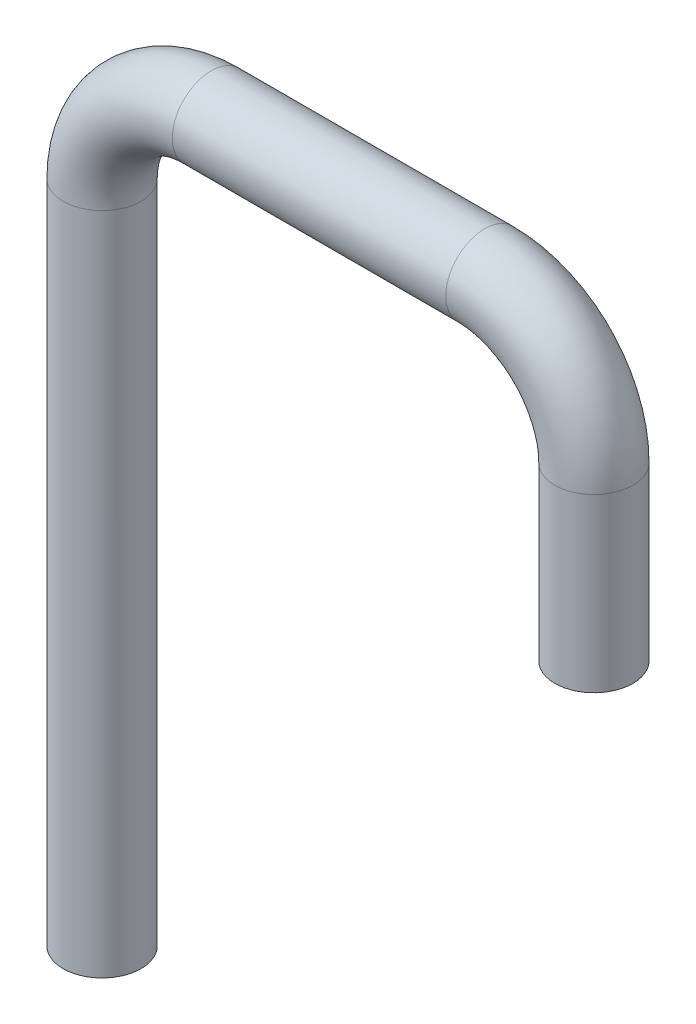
from build123d import *

# Parameters (mm, degrees)
SKETCH2_R   = 3.175
SKETCH2_R_2 = 2.286


with BuildPart() as part:
    # Sweep-Thin1: sweep along a path in Sketch1
    with BuildLine(Plane.XY) as sweep_thin1_path:
        Line((0, 0), (0, 54.102))
        ThreePointArc((0, 54.102), (2.603820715, 60.388179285), (8.89, 62.992))
        Line((8.89, 62.992), (31.153678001, 62.992))
        ThreePointArc((31.153678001, 62.992), (37.439857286, 60.388179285), (40.043678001, 54.102))
        Line((40.043678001, 54.102), (40.043678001, 40.132))
    # Sketch2 → Sweep-Thin1 (sweep)
    with BuildSketch(Plane(origin=(0, 0, 0), x_dir=(1, 0, 0), z_dir=(0, 1, 0))):
        Circle(SKETCH2_R)
        Circle(SKETCH2_R_2, mode=Mode.SUBTRACT)
    sweep(path=sweep_thin1_path.line)


solid = part.part
